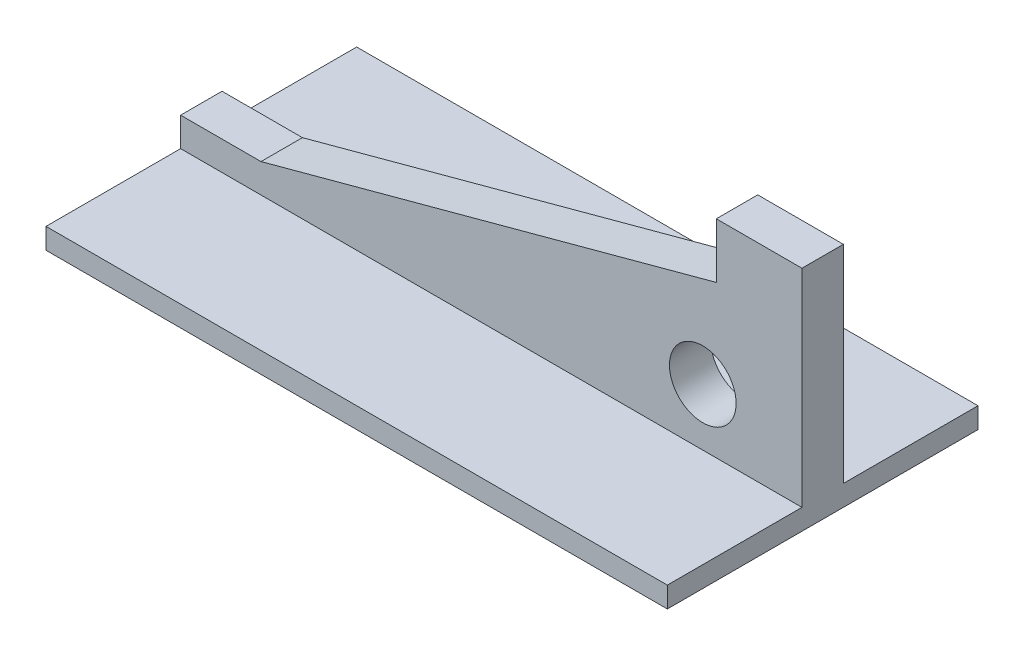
ISO-10303-21;
HEADER;
FILE_DESCRIPTION(('STEP AP214'),'2;1');
FILE_NAME('part.step','',(''),(''),'','','');
FILE_SCHEMA(('AUTOMOTIVE_DESIGN { 1 0 10303 214 1 1 1 1 }'));
ENDSEC;
DATA;
#1=APPLICATION_CONTEXT('core data for automotive mechanical design processes');
#2=APPLICATION_PROTOCOL_DEFINITION('international standard','automotive_design',2000,#1);
#3=PRODUCT_CONTEXT('',#1,'mechanical');
#4=PRODUCT('Part','Part','',(#3));
#5=PRODUCT_RELATED_PRODUCT_CATEGORY('part','',(#4));
#6=PRODUCT_DEFINITION_FORMATION('','',#4);
#7=PRODUCT_DEFINITION_CONTEXT('part definition',#1,'design');
#8=PRODUCT_DEFINITION('design','',#6,#7);
#9=PRODUCT_DEFINITION_SHAPE('','',#8);
#10=(LENGTH_UNIT() NAMED_UNIT(*) SI_UNIT(.MILLI.,.METRE.));
#11=(NAMED_UNIT(*) PLANE_ANGLE_UNIT() SI_UNIT($,.RADIAN.));
#12=(NAMED_UNIT(*) SI_UNIT($,.STERADIAN.) SOLID_ANGLE_UNIT());
#13=UNCERTAINTY_MEASURE_WITH_UNIT(LENGTH_MEASURE(1.E-05),#10,'distance_accuracy_value','');
#14=(GEOMETRIC_REPRESENTATION_CONTEXT(3) GLOBAL_UNCERTAINTY_ASSIGNED_CONTEXT((#13)) GLOBAL_UNIT_ASSIGNED_CONTEXT((#10,
#11,#12)) REPRESENTATION_CONTEXT('',''));
#15=CARTESIAN_POINT('',(0.,0.,0.));
#16=DIRECTION('',(0.,0.,1.));
#17=DIRECTION('',(1.,0.,0.));
#18=AXIS2_PLACEMENT_3D('',#15,#16,#17);
#19=CARTESIAN_POINT('',(-75.,5.,37.5));
#20=DIRECTION('',(0.,1.,0.));
#21=DIRECTION('',(0.,0.,1.));
#22=AXIS2_PLACEMENT_3D('',#19,#20,#21);
#23=PLANE('',#22);
#24=DIRECTION('',(0.,0.,1.));
#25=VECTOR('',#24,1.);
#26=CARTESIAN_POINT('',(-75.,5.,-37.5));
#27=LINE('',#26,#25);
#28=CARTESIAN_POINT('',(-75.,5.,-37.5));
#29=VERTEX_POINT('',#28);
#30=CARTESIAN_POINT('',(-75.,5.,-5.));
#31=VERTEX_POINT('',#30);
#32=EDGE_CURVE('E253',#29,#31,#27,.T.);
#33=ORIENTED_EDGE('',*,*,#32,.T.);
#34=DIRECTION('',(1.,0.,0.));
#35=VECTOR('',#34,1.);
#36=CARTESIAN_POINT('',(75.,5.,-5.));
#37=LINE('',#36,#35);
#38=CARTESIAN_POINT('',(75.,5.,-5.));
#39=VERTEX_POINT('',#38);
#40=EDGE_CURVE('E50',#31,#39,#37,.T.);
#41=ORIENTED_EDGE('',*,*,#40,.T.);
#42=DIRECTION('',(0.,0.,-1.));
#43=VECTOR('',#42,1.);
#44=CARTESIAN_POINT('',(75.,5.,-37.5));
#45=LINE('',#44,#43);
#46=CARTESIAN_POINT('',(75.,5.,-37.5));
#47=VERTEX_POINT('',#46);
#48=EDGE_CURVE('E125',#39,#47,#45,.T.);
#49=ORIENTED_EDGE('',*,*,#48,.T.);
#50=DIRECTION('',(-1.,0.,0.));
#51=VECTOR('',#50,1.);
#52=CARTESIAN_POINT('',(-75.,5.,-37.5));
#53=LINE('',#52,#51);
#54=EDGE_CURVE('E259',#47,#29,#53,.T.);
#55=ORIENTED_EDGE('',*,*,#54,.T.);
#56=EDGE_LOOP('',(#33,#41,#49,#55));
#57=FACE_BOUND('',#56,.T.);
#58=ADVANCED_FACE('F33',(#57),#23,.T.);
#59=CARTESIAN_POINT('',(-75.,5.,-37.5));
#60=DIRECTION('',(1.,0.,0.));
#61=DIRECTION('',(0.,0.,-1.));
#62=AXIS2_PLACEMENT_3D('',#59,#60,#61);
#63=PLANE('',#62);
#64=DIRECTION('',(0.,0.,1.));
#65=VECTOR('',#64,1.);
#66=CARTESIAN_POINT('',(-75.,0.,-37.5));
#67=LINE('',#66,#65);
#68=CARTESIAN_POINT('',(-75.,0.,-37.5));
#69=VERTEX_POINT('',#68);
#70=CARTESIAN_POINT('',(-75.,0.,37.5));
#71=VERTEX_POINT('',#70);
#72=EDGE_CURVE('E134',#69,#71,#67,.T.);
#73=ORIENTED_EDGE('',*,*,#72,.T.);
#74=DIRECTION('',(0.,-1.,0.));
#75=VECTOR('',#74,1.);
#76=CARTESIAN_POINT('',(-75.,5.,37.5));
#77=LINE('',#76,#75);
#78=CARTESIAN_POINT('',(-75.,5.,37.5));
#79=VERTEX_POINT('',#78);
#80=EDGE_CURVE('E11',#79,#71,#77,.T.);
#81=ORIENTED_EDGE('',*,*,#80,.F.);
#82=CARTESIAN_POINT('',(-75.,5.,5.));
#83=VERTEX_POINT('',#82);
#84=EDGE_CURVE('E243',#83,#79,#27,.T.);
#85=ORIENTED_EDGE('',*,*,#84,.F.);
#86=DIRECTION('',(0.,-1.,0.));
#87=VECTOR('',#86,1.);
#88=CARTESIAN_POINT('',(-75.,5.,5.));
#89=LINE('',#88,#87);
#90=CARTESIAN_POINT('',(-75.,12.,5.));
#91=VERTEX_POINT('',#90);
#92=EDGE_CURVE('E153',#91,#83,#89,.T.);
#93=ORIENTED_EDGE('',*,*,#92,.F.);
#94=DIRECTION('',(0.,0.,-1.));
#95=VECTOR('',#94,1.);
#96=CARTESIAN_POINT('',(-75.,12.,5.));
#97=LINE('',#96,#95);
#98=CARTESIAN_POINT('',(-75.,12.,-5.));
#99=VERTEX_POINT('',#98);
#100=EDGE_CURVE('E272',#91,#99,#97,.T.);
#101=ORIENTED_EDGE('',*,*,#100,.T.);
#102=DIRECTION('',(0.,-1.,0.));
#103=VECTOR('',#102,1.);
#104=CARTESIAN_POINT('',(-75.,5.,-5.));
#105=LINE('',#104,#103);
#106=EDGE_CURVE('E171',#99,#31,#105,.T.);
#107=ORIENTED_EDGE('',*,*,#106,.T.);
#108=ORIENTED_EDGE('',*,*,#32,.F.);
#109=DIRECTION('',(0.,-1.,0.));
#110=VECTOR('',#109,1.);
#111=CARTESIAN_POINT('',(-75.,5.,-37.5));
#112=LINE('',#111,#110);
#113=EDGE_CURVE('E256',#29,#69,#112,.T.);
#114=ORIENTED_EDGE('',*,*,#113,.T.);
#115=EDGE_LOOP('',(#73,#81,#85,#93,#101,#107,#108,#114));
#116=FACE_BOUND('',#115,.T.);
#117=ADVANCED_FACE('F35',(#116),#63,.F.);
#118=CARTESIAN_POINT('',(-75.,5.,37.5));
#119=DIRECTION('',(0.,0.,-1.));
#120=DIRECTION('',(-1.,0.,0.));
#121=AXIS2_PLACEMENT_3D('',#118,#119,#120);
#122=PLANE('',#121);
#123=DIRECTION('',(1.,0.,0.));
#124=VECTOR('',#123,1.);
#125=CARTESIAN_POINT('',(-75.,0.,37.5));
#126=LINE('',#125,#124);
#127=CARTESIAN_POINT('',(75.,0.,37.5));
#128=VERTEX_POINT('',#127);
#129=EDGE_CURVE('E226',#71,#128,#126,.T.);
#130=ORIENTED_EDGE('',*,*,#129,.T.);
#131=DIRECTION('',(0.,-1.,0.));
#132=VECTOR('',#131,1.);
#133=CARTESIAN_POINT('',(75.,5.,37.5));
#134=LINE('',#133,#132);
#135=CARTESIAN_POINT('',(75.,5.,37.5));
#136=VERTEX_POINT('',#135);
#137=EDGE_CURVE('E42',#136,#128,#134,.T.);
#138=ORIENTED_EDGE('',*,*,#137,.F.);
#139=DIRECTION('',(1.,0.,0.));
#140=VECTOR('',#139,1.);
#141=CARTESIAN_POINT('',(-75.,5.,37.5));
#142=LINE('',#141,#140);
#143=EDGE_CURVE('E249',#79,#136,#142,.T.);
#144=ORIENTED_EDGE('',*,*,#143,.F.);
#145=ORIENTED_EDGE('',*,*,#80,.T.);
#146=EDGE_LOOP('',(#130,#138,#144,#145));
#147=FACE_BOUND('',#146,.T.);
#148=ADVANCED_FACE('F204',(#147),#122,.F.);
#149=CARTESIAN_POINT('',(75.,5.,-37.5));
#150=DIRECTION('',(-1.,0.,0.));
#151=DIRECTION('',(0.,0.,1.));
#152=AXIS2_PLACEMENT_3D('',#149,#150,#151);
#153=PLANE('',#152);
#154=DIRECTION('',(0.,0.,-1.));
#155=VECTOR('',#154,1.);
#156=CARTESIAN_POINT('',(75.,0.,-37.5));
#157=LINE('',#156,#155);
#158=CARTESIAN_POINT('',(75.,0.,-37.5));
#159=VERTEX_POINT('',#158);
#160=EDGE_CURVE('E234',#128,#159,#157,.T.);
#161=ORIENTED_EDGE('',*,*,#160,.T.);
#162=DIRECTION('',(0.,-1.,0.));
#163=VECTOR('',#162,1.);
#164=CARTESIAN_POINT('',(75.,5.,-37.5));
#165=LINE('',#164,#163);
#166=EDGE_CURVE('E238',#47,#159,#165,.T.);
#167=ORIENTED_EDGE('',*,*,#166,.F.);
#168=ORIENTED_EDGE('',*,*,#48,.F.);
#169=DIRECTION('',(0.,1.,0.));
#170=VECTOR('',#169,1.);
#171=CARTESIAN_POINT('',(75.,55.,-5.));
#172=LINE('',#171,#170);
#173=CARTESIAN_POINT('',(75.,55.,-5.));
#174=VERTEX_POINT('',#173);
#175=EDGE_CURVE('E118',#39,#174,#172,.T.);
#176=ORIENTED_EDGE('',*,*,#175,.T.);
#177=DIRECTION('',(0.,0.,-1.));
#178=VECTOR('',#177,1.);
#179=CARTESIAN_POINT('',(75.,55.,5.));
#180=LINE('',#179,#178);
#181=CARTESIAN_POINT('',(75.,55.,5.));
#182=VERTEX_POINT('',#181);
#183=EDGE_CURVE('E122',#182,#174,#180,.T.);
#184=ORIENTED_EDGE('',*,*,#183,.F.);
#185=DIRECTION('',(0.,1.,0.));
#186=VECTOR('',#185,1.);
#187=CARTESIAN_POINT('',(75.,55.,5.));
#188=LINE('',#187,#186);
#189=CARTESIAN_POINT('',(75.,5.,5.));
#190=VERTEX_POINT('',#189);
#191=EDGE_CURVE('E160',#190,#182,#188,.T.);
#192=ORIENTED_EDGE('',*,*,#191,.F.);
#193=EDGE_CURVE('E237',#136,#190,#45,.T.);
#194=ORIENTED_EDGE('',*,*,#193,.F.);
#195=ORIENTED_EDGE('',*,*,#137,.T.);
#196=EDGE_LOOP('',(#161,#167,#168,#176,#184,#192,#194,#195));
#197=FACE_BOUND('',#196,.T.);
#198=ADVANCED_FACE('F120',(#197),#153,.F.);
#199=CARTESIAN_POINT('',(-75.,5.,-37.5));
#200=DIRECTION('',(0.,0.,1.));
#201=DIRECTION('',(1.,0.,0.));
#202=AXIS2_PLACEMENT_3D('',#199,#200,#201);
#203=PLANE('',#202);
#204=DIRECTION('',(-1.,0.,0.));
#205=VECTOR('',#204,1.);
#206=CARTESIAN_POINT('',(-75.,0.,-37.5));
#207=LINE('',#206,#205);
#208=EDGE_CURVE('E241',#159,#69,#207,.T.);
#209=ORIENTED_EDGE('',*,*,#208,.T.);
#210=ORIENTED_EDGE('',*,*,#113,.F.);
#211=ORIENTED_EDGE('',*,*,#54,.F.);
#212=ORIENTED_EDGE('',*,*,#166,.T.);
#213=EDGE_LOOP('',(#209,#210,#211,#212));
#214=FACE_BOUND('',#213,.T.);
#215=ADVANCED_FACE('F209',(#214),#203,.F.);
#216=DIRECTION('',(1.,0.,0.));
#217=VECTOR('',#216,1.);
#218=CARTESIAN_POINT('',(75.,5.,5.));
#219=LINE('',#218,#217);
#220=EDGE_CURVE('E58',#83,#190,#219,.T.);
#221=ORIENTED_EDGE('',*,*,#220,.F.);
#222=ORIENTED_EDGE('',*,*,#84,.T.);
#223=ORIENTED_EDGE('',*,*,#143,.T.);
#224=ORIENTED_EDGE('',*,*,#193,.T.);
#225=EDGE_LOOP('',(#221,#222,#223,#224));
#226=FACE_BOUND('',#225,.T.);
#227=ADVANCED_FACE('F200',(#226),#23,.T.);
#228=CARTESIAN_POINT('',(-75.,0.,37.5));
#229=DIRECTION('',(0.,1.,0.));
#230=DIRECTION('',(0.,0.,1.));
#231=AXIS2_PLACEMENT_3D('',#228,#229,#230);
#232=PLANE('',#231);
#233=ORIENTED_EDGE('',*,*,#72,.F.);
#234=ORIENTED_EDGE('',*,*,#208,.F.);
#235=ORIENTED_EDGE('',*,*,#160,.F.);
#236=ORIENTED_EDGE('',*,*,#129,.F.);
#237=EDGE_LOOP('',(#233,#234,#235,#236));
#238=FACE_BOUND('',#237,.T.);
#239=ADVANCED_FACE('F208',(#238),#232,.F.);
#240=CARTESIAN_POINT('',(-75.,12.,5.));
#241=DIRECTION('',(0.,0.,-1.));
#242=DIRECTION('',(-1.,0.,0.));
#243=AXIS2_PLACEMENT_3D('',#240,#241,#242);
#244=PLANE('',#243);
#245=ORIENTED_EDGE('',*,*,#92,.T.);
#246=ORIENTED_EDGE('',*,*,#220,.T.);
#247=ORIENTED_EDGE('',*,*,#191,.T.);
#248=DIRECTION('',(-1.,0.,0.));
#249=VECTOR('',#248,1.);
#250=CARTESIAN_POINT('',(54.32847428,55.,5.));
#251=LINE('',#250,#249);
#252=CARTESIAN_POINT('',(54.32847428,55.,5.));
#253=VERTEX_POINT('',#252);
#254=EDGE_CURVE('E133',#182,#253,#251,.T.);
#255=ORIENTED_EDGE('',*,*,#254,.T.);
#256=DIRECTION('',(0.,-1.,0.));
#257=VECTOR('',#256,1.);
#258=CARTESIAN_POINT('',(54.32847428,55.,5.));
#259=LINE('',#258,#257);
#260=CARTESIAN_POINT('',(54.32847428,41.6944305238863,5.));
#261=VERTEX_POINT('',#260);
#262=EDGE_CURVE('E277',#253,#261,#259,.T.);
#263=ORIENTED_EDGE('',*,*,#262,.T.);
#264=DIRECTION('',(-0.965395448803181,-0.260790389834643,0.));
#265=VECTOR('',#264,1.);
#266=CARTESIAN_POINT('',(-55.59454896,12.,5.));
#267=LINE('',#266,#265);
#268=CARTESIAN_POINT('',(-55.59454896,12.,5.));
#269=VERTEX_POINT('',#268);
#270=EDGE_CURVE('E276',#261,#269,#267,.T.);
#271=ORIENTED_EDGE('',*,*,#270,.T.);
#272=DIRECTION('',(-1.,0.,0.));
#273=VECTOR('',#272,1.);
#274=CARTESIAN_POINT('',(-75.,12.,5.));
#275=LINE('',#274,#273);
#276=EDGE_CURVE('E274',#269,#91,#275,.T.);
#277=ORIENTED_EDGE('',*,*,#276,.T.);
#278=EDGE_LOOP('',(#245,#246,#247,#255,#263,#271,#277));
#279=FACE_BOUND('',#278,.T.);
#280=CARTESIAN_POINT('',(51.05709357,18.76739402,5.));
#281=DIRECTION('',(0.,0.,1.));
#282=DIRECTION('',(1.,0.,0.));
#283=AXIS2_PLACEMENT_3D('',#280,#281,#282);
#284=CIRCLE('',#283,8.04885324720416);
#285=CARTESIAN_POINT('',(59.1059468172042,18.76739402,5.));
#286=VERTEX_POINT('',#285);
#287=EDGE_CURVE('E174',#286,#286,#284,.T.);
#288=ORIENTED_EDGE('',*,*,#287,.F.);
#289=EDGE_LOOP('',(#288));
#290=FACE_BOUND('',#289,.T.);
#291=ADVANCED_FACE('F214',(#279,#290),#244,.F.);
#292=CARTESIAN_POINT('',(-75.,12.,-5.));
#293=DIRECTION('',(0.,0.,-1.));
#294=DIRECTION('',(-1.,0.,0.));
#295=AXIS2_PLACEMENT_3D('',#292,#293,#294);
#296=PLANE('',#295);
#297=ORIENTED_EDGE('',*,*,#106,.F.);
#298=DIRECTION('',(-1.,0.,0.));
#299=VECTOR('',#298,1.);
#300=CARTESIAN_POINT('',(-75.,12.,-5.));
#301=LINE('',#300,#299);
#302=CARTESIAN_POINT('',(-55.59454896,12.,-5.));
#303=VERTEX_POINT('',#302);
#304=EDGE_CURVE('E151',#303,#99,#301,.T.);
#305=ORIENTED_EDGE('',*,*,#304,.F.);
#306=DIRECTION('',(-0.965395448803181,-0.260790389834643,0.));
#307=VECTOR('',#306,1.);
#308=CARTESIAN_POINT('',(-55.59454896,12.,-5.));
#309=LINE('',#308,#307);
#310=CARTESIAN_POINT('',(54.32847428,41.6944305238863,-5.));
#311=VERTEX_POINT('',#310);
#312=EDGE_CURVE('E144',#311,#303,#309,.T.);
#313=ORIENTED_EDGE('',*,*,#312,.F.);
#314=DIRECTION('',(0.,-1.,0.));
#315=VECTOR('',#314,1.);
#316=CARTESIAN_POINT('',(54.32847428,55.,-5.));
#317=LINE('',#316,#315);
#318=CARTESIAN_POINT('',(54.32847428,55.,-5.));
#319=VERTEX_POINT('',#318);
#320=EDGE_CURVE('E142',#319,#311,#317,.T.);
#321=ORIENTED_EDGE('',*,*,#320,.F.);
#322=DIRECTION('',(-1.,0.,0.));
#323=VECTOR('',#322,1.);
#324=CARTESIAN_POINT('',(54.32847428,55.,-5.));
#325=LINE('',#324,#323);
#326=EDGE_CURVE('E128',#174,#319,#325,.T.);
#327=ORIENTED_EDGE('',*,*,#326,.F.);
#328=ORIENTED_EDGE('',*,*,#175,.F.);
#329=ORIENTED_EDGE('',*,*,#40,.F.);
#330=EDGE_LOOP('',(#297,#305,#313,#321,#327,#328,#329));
#331=FACE_BOUND('',#330,.T.);
#332=CARTESIAN_POINT('',(51.05709357,18.76739402,-5.));
#333=DIRECTION('',(0.,0.,1.));
#334=DIRECTION('',(1.,0.,0.));
#335=AXIS2_PLACEMENT_3D('',#332,#333,#334);
#336=CIRCLE('',#335,8.04885324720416);
#337=CARTESIAN_POINT('',(59.1059468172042,18.76739402,-5.));
#338=VERTEX_POINT('',#337);
#339=EDGE_CURVE('E180',#338,#338,#336,.T.);
#340=ORIENTED_EDGE('',*,*,#339,.T.);
#341=EDGE_LOOP('',(#340));
#342=FACE_BOUND('',#341,.T.);
#343=ADVANCED_FACE('F139',(#331,#342),#296,.T.);
#344=CARTESIAN_POINT('',(54.32847428,55.,5.));
#345=DIRECTION('',(0.,-1.,0.));
#346=DIRECTION('',(0.,0.,-1.));
#347=AXIS2_PLACEMENT_3D('',#344,#345,#346);
#348=PLANE('',#347);
#349=ORIENTED_EDGE('',*,*,#326,.T.);
#350=DIRECTION('',(0.,0.,-1.));
#351=VECTOR('',#350,1.);
#352=CARTESIAN_POINT('',(54.32847428,55.,5.));
#353=LINE('',#352,#351);
#354=EDGE_CURVE('E135',#253,#319,#353,.T.);
#355=ORIENTED_EDGE('',*,*,#354,.F.);
#356=ORIENTED_EDGE('',*,*,#254,.F.);
#357=ORIENTED_EDGE('',*,*,#183,.T.);
#358=EDGE_LOOP('',(#349,#355,#356,#357));
#359=FACE_BOUND('',#358,.T.);
#360=ADVANCED_FACE('F130',(#359),#348,.F.);
#361=CARTESIAN_POINT('',(54.32847428,55.,5.));
#362=DIRECTION('',(1.,0.,0.));
#363=DIRECTION('',(0.,1.,0.));
#364=AXIS2_PLACEMENT_3D('',#361,#362,#363);
#365=PLANE('',#364);
#366=ORIENTED_EDGE('',*,*,#320,.T.);
#367=DIRECTION('',(0.,0.,-1.));
#368=VECTOR('',#367,1.);
#369=CARTESIAN_POINT('',(54.32847428,41.6944305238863,5.));
#370=LINE('',#369,#368);
#371=EDGE_CURVE('E266',#261,#311,#370,.T.);
#372=ORIENTED_EDGE('',*,*,#371,.F.);
#373=ORIENTED_EDGE('',*,*,#262,.F.);
#374=ORIENTED_EDGE('',*,*,#354,.T.);
#375=EDGE_LOOP('',(#366,#372,#373,#374));
#376=FACE_BOUND('',#375,.T.);
#377=ADVANCED_FACE('F283',(#376),#365,.F.);
#378=CARTESIAN_POINT('',(-55.59454896,12.,5.));
#379=DIRECTION('',(0.260790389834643,-0.965395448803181,0.));
#380=DIRECTION('',(0.965395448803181,0.260790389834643,0.));
#381=AXIS2_PLACEMENT_3D('',#378,#379,#380);
#382=PLANE('',#381);
#383=ORIENTED_EDGE('',*,*,#312,.T.);
#384=DIRECTION('',(0.,0.,-1.));
#385=VECTOR('',#384,1.);
#386=CARTESIAN_POINT('',(-55.59454896,12.,5.));
#387=LINE('',#386,#385);
#388=EDGE_CURVE('E269',#269,#303,#387,.T.);
#389=ORIENTED_EDGE('',*,*,#388,.F.);
#390=ORIENTED_EDGE('',*,*,#270,.F.);
#391=ORIENTED_EDGE('',*,*,#371,.T.);
#392=EDGE_LOOP('',(#383,#389,#390,#391));
#393=FACE_BOUND('',#392,.T.);
#394=ADVANCED_FACE('F194',(#393),#382,.F.);
#395=CARTESIAN_POINT('',(-75.,12.,5.));
#396=DIRECTION('',(0.,-1.,0.));
#397=DIRECTION('',(0.,0.,-1.));
#398=AXIS2_PLACEMENT_3D('',#395,#396,#397);
#399=PLANE('',#398);
#400=ORIENTED_EDGE('',*,*,#304,.T.);
#401=ORIENTED_EDGE('',*,*,#100,.F.);
#402=ORIENTED_EDGE('',*,*,#276,.F.);
#403=ORIENTED_EDGE('',*,*,#388,.T.);
#404=EDGE_LOOP('',(#400,#401,#402,#403));
#405=FACE_BOUND('',#404,.T.);
#406=ADVANCED_FACE('F189',(#405),#399,.F.);
#407=CARTESIAN_POINT('',(51.05709357,18.76739402,5.));
#408=DIRECTION('',(0.,0.,-1.));
#409=DIRECTION('',(-1.,0.,0.));
#410=AXIS2_PLACEMENT_3D('',#407,#408,#409);
#411=CYLINDRICAL_SURFACE('',#410,8.04885324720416);
#412=ORIENTED_EDGE('',*,*,#287,.T.);
#413=EDGE_LOOP('',(#412));
#414=FACE_BOUND('',#413,.T.);
#415=ORIENTED_EDGE('',*,*,#339,.F.);
#416=EDGE_LOOP('',(#415));
#417=FACE_BOUND('',#416,.T.);
#418=ADVANCED_FACE('F187',(#414,#417),#411,.F.);
#419=CLOSED_SHELL('',(#58,#117,#148,#198,#215,#227,#239,#291,#343,#360,#377,#394,#406,#418));
#420=MANIFOLD_SOLID_BREP('B2',#419);
#421=ADVANCED_BREP_SHAPE_REPRESENTATION('',(#18,#420),#14);
#422=SHAPE_DEFINITION_REPRESENTATION(#9,#421);
ENDSEC;
END-ISO-10303-21;
